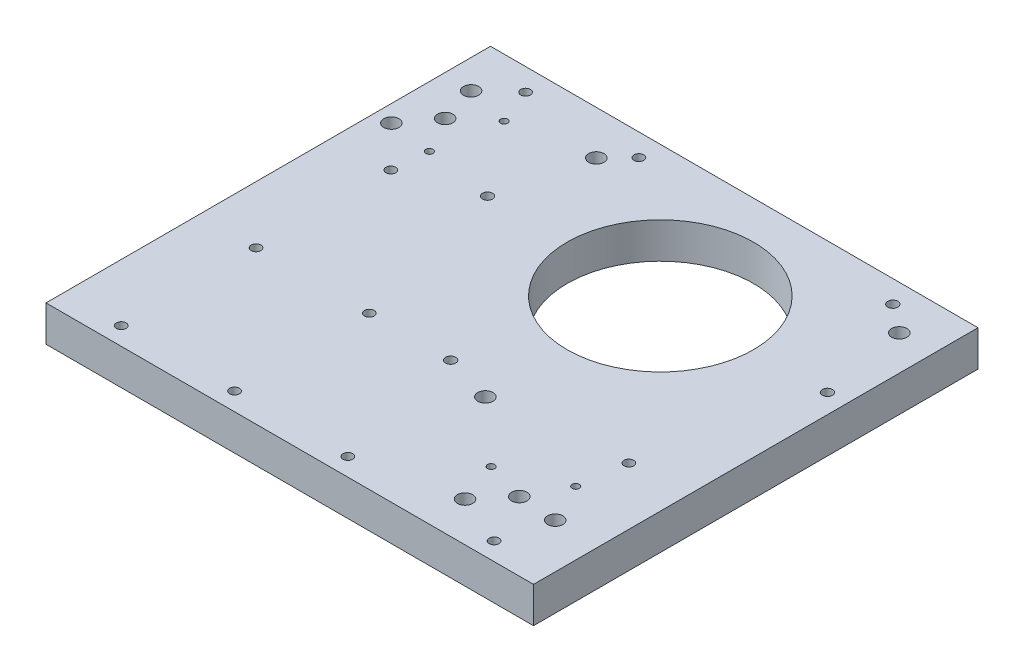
from build123d import *

# Parameters (mm, degrees)
SKETCH1_W                                           = 215.9
SKETCH1_H                                           = 196.85
SKETCH1_R                                           = 41.275
BOSS_EXTRUDE1_DEPTH                                 = 15.875
SKETCH2_R                                           = 3.3782
CUT_EXTRUDE1_DEPTH                                  = 147.944543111
CBORE_FOR_8_BINDING_HEAD_MACHINE_SCREW1_D           = 4.3053
CBORE_FOR_8_BINDING_HEAD_MACHINE_SCREW1_CBORE_D     = 7.9375
CBORE_FOR_8_BINDING_HEAD_MACHINE_SCREW1_CBORE_DEPTH = 4.4196
CBORE_FOR_8_BINDING_HEAD_MACHINE_SCREW2_D           = 4.4958
CBORE_FOR_8_BINDING_HEAD_MACHINE_SCREW2_CBORE_D     = 7.9375
CBORE_FOR_8_BINDING_HEAD_MACHINE_SCREW2_CBORE_DEPTH = 4.4196
SKETCH19_R                                          = 3.3782
CUT_EXTRUDE2_DEPTH                                  = 147.944543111
SKETCH20_R                                          = 1.5875
CUT_EXTRUDE3_DEPTH                                  = 147.944543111
SKETCH23_R                                          = 3.3782
CUT_EXTRUDE4_DEPTH                                  = 147.944543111
SKETCH24_R                                          = 1.5875
CUT_EXTRUDE5_DEPTH                                  = 147.944543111
SKETCH25_R                                          = 3.3782
CUT_EXTRUDE6_DEPTH                                  = 19.05
SKETCH26_R                                          = 1.5875
CUT_EXTRUDE7_DEPTH                                  = 6.35


with BuildPart() as part:
    # Sketch1 → Boss-Extrude1 (new body)
    with BuildSketch(Plane(origin=(0, 0, 0), x_dir=(1, 0, 0), z_dir=(0, 1, 0))):
        Rectangle(SKETCH1_W, SKETCH1_H)
        with Locations(Location((25.4, 40.2844, 0), (0, 0, 270))):
            Circle(SKETCH1_R, mode=Mode.SUBTRACT)
    extrude(amount=BOSS_EXTRUDE1_DEPTH)

    # Sketch2 → Cut-Extrude1 (cut, through all)
    with BuildSketch(Plane(origin=(0, 15.875, 0), x_dir=(1, 0, 0), z_dir=(0, 1, 0))):
        with Locations(Location((25.4, -37.1856, 0), (0, 0, 270))):
            Circle(SKETCH2_R)
        with Locations(Location((-41.690988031, 79.0194, 0), (0, 0, 270))):
            Circle(SKETCH2_R)
        with Locations(Location((92.490988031, 79.0194, 0), (0, 0, 270))):
            Circle(SKETCH2_R)
    extrude(amount=-CUT_EXTRUDE1_DEPTH, mode=Mode.SUBTRACT)

    # CBORE for _8 Binding Head Machine Screw1 (through all)
    with Locations(Plane(origin=(0, 0, 0), x_dir=(-1, 0, 0), z_dir=(0, -1, 0))):
        with Locations((82.55, -90.4875), (32.385, -90.4875), (82.55, -30.7975), (82.55, 28.8925), (82.55, 88.5825), (32.385, 88.5825), (32.385, -30.7975), (-17.78, -90.4875), (-82.55, -90.4875), (-82.55, -30.7975)):
            CounterBoreHole(CBORE_FOR_8_BINDING_HEAD_MACHINE_SCREW1_D / 2, CBORE_FOR_8_BINDING_HEAD_MACHINE_SCREW1_CBORE_D / 2, CBORE_FOR_8_BINDING_HEAD_MACHINE_SCREW1_CBORE_DEPTH)

    # CBORE for _8 Binding Head Machine Screw2 (through all)
    with Locations(Plane(origin=(0, 0, 0), x_dir=(-1, 0, 0), z_dir=(0, -1, 0))):
        with Locations((-99.401064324, 40.2844), (-3.621179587, -30.7975), (51.11018312, 40.2844), (-80.066615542, 88.5825)):
            CounterBoreHole(CBORE_FOR_8_BINDING_HEAD_MACHINE_SCREW2_D / 2, CBORE_FOR_8_BINDING_HEAD_MACHINE_SCREW2_CBORE_D / 2, CBORE_FOR_8_BINDING_HEAD_MACHINE_SCREW2_CBORE_DEPTH)

    # Sketch19 → Cut-Extrude2 (cut, through all)
    with BuildSketch(Plane.XZ):
        with Locations(Location((88.146864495, 69.003511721, 0), (0, 0, 270))):
            Circle(SKETCH19_R)
        with Locations(Location((71.142570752, 67.919079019, 0), (0, 0, 270))):
            Circle(SKETCH19_R)
        with Locations(Location((60.072448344, 80.871854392, 0), (0, 0, 270))):
            Circle(SKETCH19_R)
    extrude(amount=-CUT_EXTRUDE2_DEPTH, mode=Mode.SUBTRACT)

    # Sketch20 → Cut-Extrude3 (cut, through all)
    with BuildSketch(Plane.XZ):
        with Locations(Location((79.709794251, 51.491915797, 0), (0, 0, 270))):
            Circle(SKETCH20_R)
        with Locations(Location((53.390029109, 62.61848705, 0), (0, 0, 270))):
            Circle(SKETCH20_R)
    extrude(amount=-CUT_EXTRUDE3_DEPTH, mode=Mode.SUBTRACT)

    # Sketch23 → Cut-Extrude4 (cut, through all)
    with BuildSketch(Plane(origin=(0, 0, 0), x_dir=(-1, 0, 0), z_dir=(0, -1, 0))):
        with Locations(Location((100.439252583, 47.007928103, 0), (0, 0, 90))):
            Circle(SKETCH23_R)
        with Locations(Location((90.288619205, 60.693199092, 0), (0, 0, 90))):
            Circle(SKETCH23_R)
        with Locations(Location((95.14645597, 77.024868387, 0), (0, 0, 90))):
            Circle(SKETCH23_R)
    extrude(amount=-CUT_EXTRUDE4_DEPTH, mode=Mode.SUBTRACT)

    # Sketch24 → Cut-Extrude5 (cut, through all)
    with BuildSketch(Plane(origin=(0, 0, 0), x_dir=(-1, 0, 0), z_dir=(0, -1, 0))):
        with Locations(Location((81.154046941, 44.574619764, 0), (0, 0, 90))):
            Circle(SKETCH24_R)
        with Locations(Location((76.192050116, 72.71550128, 0), (0, 0, 90))):
            Circle(SKETCH24_R)
    extrude(amount=-CUT_EXTRUDE5_DEPTH, mode=Mode.SUBTRACT)

    # Sketch25 → Cut-Extrude6 (cut)
    with BuildSketch(Plane(origin=(0, 0, -98.425), x_dir=(-1, 0, 0), z_dir=(0, 0, -1))):
        with Locations((-57.548940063, 7.9375)):
            Circle(SKETCH25_R)
        with Locations((2.776059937, 7.9375)):
            Circle(SKETCH25_R)
    extrude(amount=-CUT_EXTRUDE6_DEPTH, mode=Mode.SUBTRACT)

    # Sketch26 → Cut-Extrude7 (cut)
    with BuildSketch(Plane(origin=(0, 0, -98.425), x_dir=(-1, 0, 0), z_dir=(0, 0, -1))):
        with Locations((-43.261440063, 7.9375)):
            Circle(SKETCH26_R)
        with Locations((-11.511440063, 7.9375)):
            Circle(SKETCH26_R)
    extrude(amount=-CUT_EXTRUDE7_DEPTH, mode=Mode.SUBTRACT)


solid = part.part
